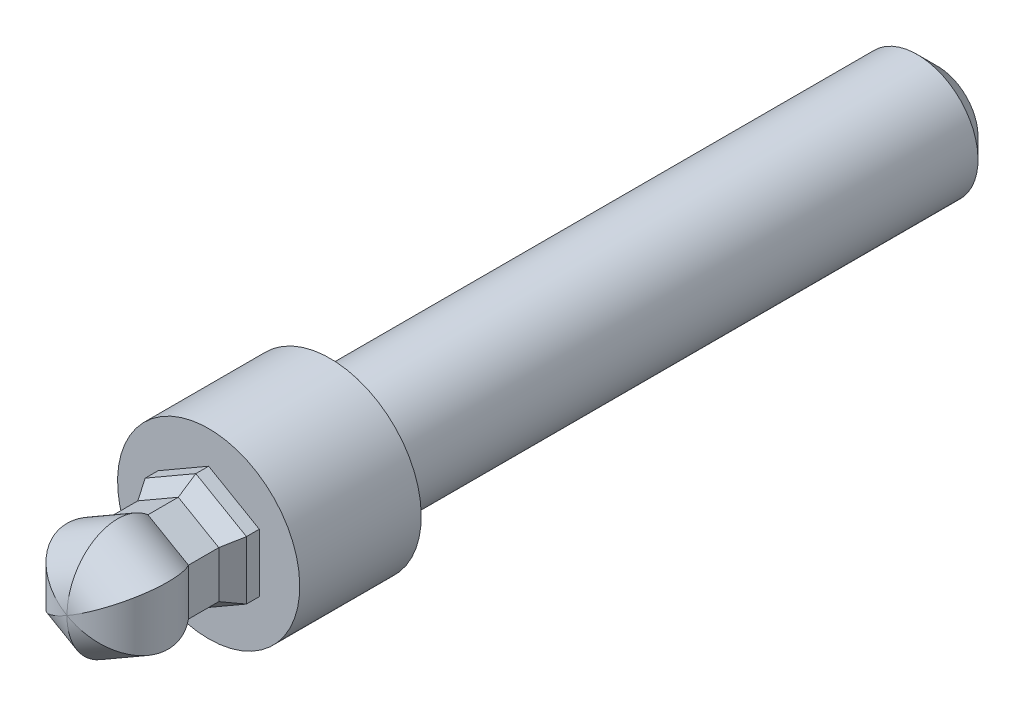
ISO-10303-21;
HEADER;
FILE_DESCRIPTION(('STEP AP214'),'2;1');
FILE_NAME('part.step','',(''),(''),'','','');
FILE_SCHEMA(('AUTOMOTIVE_DESIGN { 1 0 10303 214 1 1 1 1 }'));
ENDSEC;
DATA;
#1=APPLICATION_CONTEXT('core data for automotive mechanical design processes');
#2=APPLICATION_PROTOCOL_DEFINITION('international standard','automotive_design',2000,#1);
#3=PRODUCT_CONTEXT('',#1,'mechanical');
#4=PRODUCT('Part','Part','',(#3));
#5=PRODUCT_RELATED_PRODUCT_CATEGORY('part','',(#4));
#6=PRODUCT_DEFINITION_FORMATION('','',#4);
#7=PRODUCT_DEFINITION_CONTEXT('part definition',#1,'design');
#8=PRODUCT_DEFINITION('design','',#6,#7);
#9=PRODUCT_DEFINITION_SHAPE('','',#8);
#10=(LENGTH_UNIT() NAMED_UNIT(*) SI_UNIT(.MILLI.,.METRE.));
#11=(NAMED_UNIT(*) PLANE_ANGLE_UNIT() SI_UNIT($,.RADIAN.));
#12=(NAMED_UNIT(*) SI_UNIT($,.STERADIAN.) SOLID_ANGLE_UNIT());
#13=UNCERTAINTY_MEASURE_WITH_UNIT(LENGTH_MEASURE(1.E-05),#10,'distance_accuracy_value','');
#14=(GEOMETRIC_REPRESENTATION_CONTEXT(3) GLOBAL_UNCERTAINTY_ASSIGNED_CONTEXT((#13)) GLOBAL_UNIT_ASSIGNED_CONTEXT((#10,
#11,#12)) REPRESENTATION_CONTEXT('',''));
#15=CARTESIAN_POINT('',(0.,0.,0.));
#16=DIRECTION('',(0.,0.,1.));
#17=DIRECTION('',(1.,0.,0.));
#18=AXIS2_PLACEMENT_3D('',#15,#16,#17);
#19=CARTESIAN_POINT('',(0.,0.,-14.));
#20=DIRECTION('',(0.,0.,-1.));
#21=DIRECTION('',(-0.866025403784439,-0.5,0.));
#22=AXIS2_PLACEMENT_3D('',#19,#20,#21);
#23=PLANE('',#22);
#24=CARTESIAN_POINT('',(0.,0.,-14.));
#25=DIRECTION('',(0.,0.,1.));
#26=DIRECTION('',(0.866025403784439,0.5,0.));
#27=AXIS2_PLACEMENT_3D('',#24,#25,#26);
#28=CIRCLE('',#27,9.);
#29=CARTESIAN_POINT('',(7.79422863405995,4.5,-14.));
#30=VERTEX_POINT('',#29);
#31=EDGE_CURVE('E210',#30,#30,#28,.T.);
#32=ORIENTED_EDGE('',*,*,#31,.T.);
#33=EDGE_LOOP('',(#32));
#34=FACE_BOUND('',#33,.T.);
#35=DIRECTION('',(0.866025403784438,-0.5,0.));
#36=VECTOR('',#35,1.);
#37=CARTESIAN_POINT('',(-2.5,-4.33012701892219,-14.));
#38=LINE('',#37,#36);
#39=CARTESIAN_POINT('',(-5.,-2.88675134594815,-14.));
#40=VERTEX_POINT('',#39);
#41=CARTESIAN_POINT('',(0.,-5.77350269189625,-14.));
#42=VERTEX_POINT('',#41);
#43=EDGE_CURVE('E29',#40,#42,#38,.T.);
#44=ORIENTED_EDGE('',*,*,#43,.F.);
#45=DIRECTION('',(0.,-1.,0.));
#46=VECTOR('',#45,1.);
#47=CARTESIAN_POINT('',(-5.,0.,-14.));
#48=LINE('',#47,#46);
#49=CARTESIAN_POINT('',(-5.,2.88675134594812,-14.));
#50=VERTEX_POINT('',#49);
#51=EDGE_CURVE('E223',#50,#40,#48,.T.);
#52=ORIENTED_EDGE('',*,*,#51,.F.);
#53=DIRECTION('',(-0.866025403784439,-0.5,0.));
#54=VECTOR('',#53,1.);
#55=CARTESIAN_POINT('',(-2.5,4.3301270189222,-14.));
#56=LINE('',#55,#54);
#57=CARTESIAN_POINT('',(0.,5.77350269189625,-14.));
#58=VERTEX_POINT('',#57);
#59=EDGE_CURVE('E37',#58,#50,#56,.T.);
#60=ORIENTED_EDGE('',*,*,#59,.F.);
#61=DIRECTION('',(-0.866025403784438,0.5,0.));
#62=VECTOR('',#61,1.);
#63=CARTESIAN_POINT('',(2.5,4.33012701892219,-14.));
#64=LINE('',#63,#62);
#65=CARTESIAN_POINT('',(5.,2.88675134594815,-14.));
#66=VERTEX_POINT('',#65);
#67=EDGE_CURVE('E213',#66,#58,#64,.T.);
#68=ORIENTED_EDGE('',*,*,#67,.F.);
#69=DIRECTION('',(0.,1.,0.));
#70=VECTOR('',#69,1.);
#71=CARTESIAN_POINT('',(5.,0.,-14.));
#72=LINE('',#71,#70);
#73=CARTESIAN_POINT('',(5.,-2.88675134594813,-14.));
#74=VERTEX_POINT('',#73);
#75=EDGE_CURVE('E216',#74,#66,#72,.T.);
#76=ORIENTED_EDGE('',*,*,#75,.F.);
#77=DIRECTION('',(0.866025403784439,0.5,0.));
#78=VECTOR('',#77,1.);
#79=CARTESIAN_POINT('',(2.5,-4.3301270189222,-14.));
#80=LINE('',#79,#78);
#81=EDGE_CURVE('E219',#42,#74,#80,.T.);
#82=ORIENTED_EDGE('',*,*,#81,.F.);
#83=EDGE_LOOP('',(#44,#52,#60,#68,#76,#82));
#84=FACE_BOUND('',#83,.T.);
#85=ADVANCED_FACE('F14',(#34,#84),#23,.F.);
#86=CARTESIAN_POINT('',(0.,0.,-14.));
#87=DIRECTION('',(0.,0.,1.));
#88=DIRECTION('',(0.866025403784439,0.5,0.));
#89=AXIS2_PLACEMENT_3D('',#86,#87,#88);
#90=CYLINDRICAL_SURFACE('',#89,9.);
#91=ORIENTED_EDGE('',*,*,#31,.F.);
#92=EDGE_LOOP('',(#91));
#93=FACE_BOUND('',#92,.T.);
#94=CARTESIAN_POINT('',(0.,0.,-26.));
#95=DIRECTION('',(0.,0.,1.));
#96=DIRECTION('',(0.866025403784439,0.5,0.));
#97=AXIS2_PLACEMENT_3D('',#94,#95,#96);
#98=CIRCLE('',#97,9.);
#99=CARTESIAN_POINT('',(7.79422863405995,4.5,-26.));
#100=VERTEX_POINT('',#99);
#101=EDGE_CURVE('E207',#100,#100,#98,.T.);
#102=ORIENTED_EDGE('',*,*,#101,.T.);
#103=EDGE_LOOP('',(#102));
#104=FACE_BOUND('',#103,.T.);
#105=ADVANCED_FACE('F264',(#93,#104),#90,.T.);
#106=CARTESIAN_POINT('',(4.5,-7.79422863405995,-26.));
#107=DIRECTION('',(0.,0.,1.));
#108=DIRECTION('',(0.866025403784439,0.5,0.));
#109=AXIS2_PLACEMENT_3D('',#106,#107,#108);
#110=PLANE('',#109);
#111=ORIENTED_EDGE('',*,*,#101,.F.);
#112=EDGE_LOOP('',(#111));
#113=FACE_BOUND('',#112,.T.);
#114=CARTESIAN_POINT('',(0.,0.,-26.));
#115=DIRECTION('',(0.,0.,1.));
#116=DIRECTION('',(0.866025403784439,0.5,0.));
#117=AXIS2_PLACEMENT_3D('',#114,#115,#116);
#118=CIRCLE('',#117,6.);
#119=CARTESIAN_POINT('',(5.19615242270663,3.,-26.));
#120=VERTEX_POINT('',#119);
#121=EDGE_CURVE('E204',#120,#120,#118,.T.);
#122=ORIENTED_EDGE('',*,*,#121,.T.);
#123=EDGE_LOOP('',(#122));
#124=FACE_BOUND('',#123,.T.);
#125=ADVANCED_FACE('F261',(#113,#124),#110,.F.);
#126=CARTESIAN_POINT('',(0.,0.,-14.));
#127=DIRECTION('',(0.,0.,1.));
#128=DIRECTION('',(0.866025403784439,0.5,0.));
#129=AXIS2_PLACEMENT_3D('',#126,#127,#128);
#130=CYLINDRICAL_SURFACE('',#129,6.);
#131=CARTESIAN_POINT('',(0.,0.,-84.));
#132=DIRECTION('',(0.,0.,1.));
#133=DIRECTION('',(0.866025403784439,0.5,0.));
#134=AXIS2_PLACEMENT_3D('',#131,#132,#133);
#135=CIRCLE('',#134,6.);
#136=CARTESIAN_POINT('',(5.19615242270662,2.99999999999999,-84.));
#137=VERTEX_POINT('',#136);
#138=EDGE_CURVE('E22',#137,#137,#135,.T.);
#139=ORIENTED_EDGE('',*,*,#138,.T.);
#140=EDGE_LOOP('',(#139));
#141=FACE_BOUND('',#140,.T.);
#142=ORIENTED_EDGE('',*,*,#121,.F.);
#143=EDGE_LOOP('',(#142));
#144=FACE_BOUND('',#143,.T.);
#145=ADVANCED_FACE('F228',(#141,#144),#130,.T.);
#146=CARTESIAN_POINT('',(3.,-5.19615242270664,-86.));
#147=DIRECTION('',(0.,0.,1.));
#148=DIRECTION('',(0.866025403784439,0.5,0.));
#149=AXIS2_PLACEMENT_3D('',#146,#147,#148);
#150=PLANE('',#149);
#151=CARTESIAN_POINT('',(0.,0.,-86.));
#152=DIRECTION('',(0.,0.,1.));
#153=DIRECTION('',(0.866025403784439,0.5,0.));
#154=AXIS2_PLACEMENT_3D('',#151,#152,#153);
#155=CIRCLE('',#154,4.);
#156=CARTESIAN_POINT('',(3.46410161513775,1.99999999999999,-86.));
#157=VERTEX_POINT('',#156);
#158=EDGE_CURVE('E9',#157,#157,#155,.F.);
#159=ORIENTED_EDGE('',*,*,#158,.T.);
#160=EDGE_LOOP('',(#159));
#161=FACE_BOUND('',#160,.T.);
#162=ADVANCED_FACE('F234',(#161),#150,.F.);
#163=CARTESIAN_POINT('',(21.650635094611,12.5,-5.));
#164=DIRECTION('',(-0.866025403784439,-0.5,0.));
#165=DIRECTION('',(0.,0.,1.));
#166=AXIS2_PLACEMENT_3D('',#163,#164,#165);
#167=CYLINDRICAL_SURFACE('',#166,5.);
#168=DIRECTION('',(-0.866025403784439,-0.5,0.));
#169=VECTOR('',#168,1.);
#170=CARTESIAN_POINT('',(19.650635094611,15.9641016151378,-8.));
#171=LINE('',#170,#169);
#172=CARTESIAN_POINT('',(0.,4.618802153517,-8.));
#173=VERTEX_POINT('',#172);
#174=CARTESIAN_POINT('',(-4.,2.30940107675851,-8.));
#175=VERTEX_POINT('',#174);
#176=EDGE_CURVE('E170',#173,#175,#171,.T.);
#177=ORIENTED_EDGE('',*,*,#176,.T.);
#178=CARTESIAN_POINT('',(0.,0.,-5.));
#179=DIRECTION('',(-0.5,-0.866025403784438,0.));
#180=DIRECTION('',(-0.866025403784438,0.5,0.));
#181=AXIS2_PLACEMENT_3D('',#178,#179,#180);
#182=ELLIPSE('',#181,5.77350269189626,5.);
#183=CARTESIAN_POINT('',(0.,0.,0.));
#184=VERTEX_POINT('',#183);
#185=EDGE_CURVE('E191',#175,#184,#182,.F.);
#186=ORIENTED_EDGE('',*,*,#185,.T.);
#187=CARTESIAN_POINT('',(0.,0.,-5.));
#188=DIRECTION('',(-1.,0.,0.));
#189=DIRECTION('',(0.,-1.,0.));
#190=AXIS2_PLACEMENT_3D('',#187,#188,#189);
#191=ELLIPSE('',#190,5.77350269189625,5.);
#192=EDGE_CURVE('E134',#184,#173,#191,.T.);
#193=ORIENTED_EDGE('',*,*,#192,.T.);
#194=EDGE_LOOP('',(#177,#186,#193));
#195=FACE_BOUND('',#194,.T.);
#196=ADVANCED_FACE('F243',(#195),#167,.T.);
#197=DIRECTION('',(-0.866025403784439,-0.5,0.));
#198=VECTOR('',#197,1.);
#199=CARTESIAN_POINT('',(23.650635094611,9.03589838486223,-8.));
#200=LINE('',#199,#198);
#201=CARTESIAN_POINT('',(4.,-2.3094010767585,-8.));
#202=VERTEX_POINT('',#201);
#203=CARTESIAN_POINT('',(0.,-4.618802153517,-8.));
#204=VERTEX_POINT('',#203);
#205=EDGE_CURVE('E169',#202,#204,#200,.T.);
#206=ORIENTED_EDGE('',*,*,#205,.F.);
#207=CARTESIAN_POINT('',(0.,0.,-5.));
#208=DIRECTION('',(-0.5,-0.866025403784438,0.));
#209=DIRECTION('',(-0.866025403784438,0.5,0.));
#210=AXIS2_PLACEMENT_3D('',#207,#208,#209);
#211=ELLIPSE('',#210,5.77350269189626,5.);
#212=EDGE_CURVE('E127',#202,#184,#211,.T.);
#213=ORIENTED_EDGE('',*,*,#212,.T.);
#214=CARTESIAN_POINT('',(0.,0.,-5.));
#215=DIRECTION('',(-1.,0.,0.));
#216=DIRECTION('',(0.,-1.,0.));
#217=AXIS2_PLACEMENT_3D('',#214,#215,#216);
#218=ELLIPSE('',#217,5.77350269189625,5.);
#219=EDGE_CURVE('E173',#184,#204,#218,.F.);
#220=ORIENTED_EDGE('',*,*,#219,.T.);
#221=EDGE_LOOP('',(#206,#213,#220));
#222=FACE_BOUND('',#221,.T.);
#223=ADVANCED_FACE('F247',(#222),#167,.T.);
#224=CARTESIAN_POINT('',(-21.650635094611,12.5,-5.));
#225=DIRECTION('',(0.866025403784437,-0.5,0.));
#226=DIRECTION('',(-0.5,-0.866025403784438,0.));
#227=AXIS2_PLACEMENT_3D('',#224,#225,#226);
#228=CYLINDRICAL_SURFACE('',#227,5.);
#229=CARTESIAN_POINT('',(0.,0.,-5.));
#230=DIRECTION('',(0.5,-0.866025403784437,0.));
#231=DIRECTION('',(-0.866025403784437,-0.5,0.));
#232=AXIS2_PLACEMENT_3D('',#229,#230,#231);
#233=ELLIPSE('',#232,5.77350269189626,5.);
#234=CARTESIAN_POINT('',(-4.,-2.30940107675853,-8.));
#235=VERTEX_POINT('',#234);
#236=EDGE_CURVE('E136',#235,#184,#233,.F.);
#237=ORIENTED_EDGE('',*,*,#236,.F.);
#238=DIRECTION('',(0.866025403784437,-0.5,0.));
#239=VECTOR('',#238,1.);
#240=CARTESIAN_POINT('',(-23.650635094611,9.03589838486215,-8.));
#241=LINE('',#240,#239);
#242=EDGE_CURVE('E539',#235,#204,#241,.T.);
#243=ORIENTED_EDGE('',*,*,#242,.T.);
#244=ORIENTED_EDGE('',*,*,#219,.F.);
#245=EDGE_LOOP('',(#237,#243,#244));
#246=FACE_BOUND('',#245,.T.);
#247=ADVANCED_FACE('F253',(#246),#228,.T.);
#248=CARTESIAN_POINT('',(0.,25.,-5.));
#249=DIRECTION('',(0.,-1.,0.));
#250=DIRECTION('',(-1.,0.,0.));
#251=AXIS2_PLACEMENT_3D('',#248,#249,#250);
#252=CYLINDRICAL_SURFACE('',#251,5.);
#253=DIRECTION('',(0.,-1.,0.));
#254=VECTOR('',#253,1.);
#255=CARTESIAN_POINT('',(-4.00000000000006,25.,-8.));
#256=LINE('',#255,#254);
#257=EDGE_CURVE('E143',#175,#235,#256,.T.);
#258=ORIENTED_EDGE('',*,*,#257,.T.);
#259=ORIENTED_EDGE('',*,*,#236,.T.);
#260=ORIENTED_EDGE('',*,*,#185,.F.);
#261=EDGE_LOOP('',(#258,#259,#260));
#262=FACE_BOUND('',#261,.T.);
#263=ADVANCED_FACE('F317',(#262),#252,.T.);
#264=DIRECTION('',(0.,-1.,0.));
#265=VECTOR('',#264,1.);
#266=CARTESIAN_POINT('',(3.99999999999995,25.,-8.));
#267=LINE('',#266,#265);
#268=CARTESIAN_POINT('',(4.,2.30940107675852,-8.));
#269=VERTEX_POINT('',#268);
#270=EDGE_CURVE('E123',#269,#202,#267,.T.);
#271=ORIENTED_EDGE('',*,*,#270,.F.);
#272=CARTESIAN_POINT('',(0.,0.,-5.));
#273=DIRECTION('',(0.5,-0.866025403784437,0.));
#274=DIRECTION('',(-0.866025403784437,-0.5,0.));
#275=AXIS2_PLACEMENT_3D('',#272,#273,#274);
#276=ELLIPSE('',#275,5.77350269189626,5.);
#277=EDGE_CURVE('E125',#269,#184,#276,.T.);
#278=ORIENTED_EDGE('',*,*,#277,.T.);
#279=ORIENTED_EDGE('',*,*,#212,.F.);
#280=EDGE_LOOP('',(#271,#278,#279));
#281=FACE_BOUND('',#280,.T.);
#282=ADVANCED_FACE('F124',(#281),#252,.T.);
#283=ORIENTED_EDGE('',*,*,#277,.F.);
#284=DIRECTION('',(0.866025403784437,-0.5,0.));
#285=VECTOR('',#284,1.);
#286=CARTESIAN_POINT('',(-19.6506350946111,15.9641016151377,-8.));
#287=LINE('',#286,#285);
#288=EDGE_CURVE('E106',#173,#269,#287,.T.);
#289=ORIENTED_EDGE('',*,*,#288,.F.);
#290=ORIENTED_EDGE('',*,*,#192,.F.);
#291=EDGE_LOOP('',(#283,#289,#290));
#292=FACE_BOUND('',#291,.T.);
#293=ADVANCED_FACE('F133',(#292),#228,.T.);
#294=CARTESIAN_POINT('',(19.650635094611,15.9641016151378,-8.));
#295=DIRECTION('',(0.5,-0.866025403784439,0.));
#296=DIRECTION('',(0.,0.,1.));
#297=AXIS2_PLACEMENT_3D('',#294,#295,#296);
#298=PLANE('',#297);
#299=DIRECTION('',(-0.866025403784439,-0.5,0.));
#300=VECTOR('',#299,1.);
#301=CARTESIAN_POINT('',(19.650635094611,15.9641016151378,-11.));
#302=LINE('',#301,#300);
#303=CARTESIAN_POINT('',(0.,4.618802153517,-11.));
#304=VERTEX_POINT('',#303);
#305=CARTESIAN_POINT('',(-4.,2.3094010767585,-11.));
#306=VERTEX_POINT('',#305);
#307=EDGE_CURVE('E174',#304,#306,#302,.T.);
#308=ORIENTED_EDGE('',*,*,#307,.T.);
#309=DIRECTION('',(0.,0.,1.));
#310=VECTOR('',#309,1.);
#311=CARTESIAN_POINT('',(-4.,2.3094010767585,-8.));
#312=LINE('',#311,#310);
#313=EDGE_CURVE('E154',#306,#175,#312,.T.);
#314=ORIENTED_EDGE('',*,*,#313,.T.);
#315=ORIENTED_EDGE('',*,*,#176,.F.);
#316=DIRECTION('',(0.,0.,-1.));
#317=VECTOR('',#316,1.);
#318=CARTESIAN_POINT('',(0.,4.618802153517,-8.));
#319=LINE('',#318,#317);
#320=EDGE_CURVE('E114',#173,#304,#319,.T.);
#321=ORIENTED_EDGE('',*,*,#320,.T.);
#322=EDGE_LOOP('',(#308,#314,#315,#321));
#323=FACE_BOUND('',#322,.T.);
#324=ADVANCED_FACE('F343',(#323),#298,.F.);
#325=CARTESIAN_POINT('',(23.650635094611,9.03589838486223,-8.));
#326=DIRECTION('',(-0.5,0.866025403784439,0.));
#327=DIRECTION('',(0.,0.,-1.));
#328=AXIS2_PLACEMENT_3D('',#325,#326,#327);
#329=PLANE('',#328);
#330=DIRECTION('',(-0.866025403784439,-0.5,0.));
#331=VECTOR('',#330,1.);
#332=CARTESIAN_POINT('',(23.650635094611,9.03589838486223,-11.));
#333=LINE('',#332,#331);
#334=CARTESIAN_POINT('',(4.,-2.30940107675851,-11.));
#335=VERTEX_POINT('',#334);
#336=CARTESIAN_POINT('',(0.,-4.61880215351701,-11.));
#337=VERTEX_POINT('',#336);
#338=EDGE_CURVE('E183',#335,#337,#333,.T.);
#339=ORIENTED_EDGE('',*,*,#338,.F.);
#340=DIRECTION('',(0.,0.,1.));
#341=VECTOR('',#340,1.);
#342=CARTESIAN_POINT('',(4.,-2.3094010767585,-8.));
#343=LINE('',#342,#341);
#344=EDGE_CURVE('E152',#335,#202,#343,.T.);
#345=ORIENTED_EDGE('',*,*,#344,.T.);
#346=ORIENTED_EDGE('',*,*,#205,.T.);
#347=DIRECTION('',(0.,0.,-1.));
#348=VECTOR('',#347,1.);
#349=CARTESIAN_POINT('',(0.,-4.618802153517,-8.));
#350=LINE('',#349,#348);
#351=EDGE_CURVE('E142',#204,#337,#350,.T.);
#352=ORIENTED_EDGE('',*,*,#351,.T.);
#353=EDGE_LOOP('',(#339,#345,#346,#352));
#354=FACE_BOUND('',#353,.T.);
#355=ADVANCED_FACE('F256',(#354),#329,.F.);
#356=CARTESIAN_POINT('',(-23.650635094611,9.03589838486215,-8.));
#357=DIRECTION('',(0.5,0.866025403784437,0.));
#358=DIRECTION('',(0.866025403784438,-0.5,0.));
#359=AXIS2_PLACEMENT_3D('',#356,#357,#358);
#360=PLANE('',#359);
#361=ORIENTED_EDGE('',*,*,#242,.F.);
#362=DIRECTION('',(0.,0.,1.));
#363=VECTOR('',#362,1.);
#364=CARTESIAN_POINT('',(-4.,-2.30940107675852,-8.));
#365=LINE('',#364,#363);
#366=CARTESIAN_POINT('',(-4.,-2.30940107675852,-11.));
#367=VERTEX_POINT('',#366);
#368=EDGE_CURVE('E137',#367,#235,#365,.T.);
#369=ORIENTED_EDGE('',*,*,#368,.F.);
#370=DIRECTION('',(0.866025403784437,-0.5,0.));
#371=VECTOR('',#370,1.);
#372=CARTESIAN_POINT('',(-23.650635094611,9.03589838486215,-11.));
#373=LINE('',#372,#371);
#374=EDGE_CURVE('E530',#367,#337,#373,.T.);
#375=ORIENTED_EDGE('',*,*,#374,.T.);
#376=ORIENTED_EDGE('',*,*,#351,.F.);
#377=EDGE_LOOP('',(#361,#369,#375,#376));
#378=FACE_BOUND('',#377,.T.);
#379=ADVANCED_FACE('F360',(#378),#360,.F.);
#380=CARTESIAN_POINT('',(-4.00000000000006,25.,-8.));
#381=DIRECTION('',(1.,0.,0.));
#382=DIRECTION('',(0.,-1.,0.));
#383=AXIS2_PLACEMENT_3D('',#380,#381,#382);
#384=PLANE('',#383);
#385=DIRECTION('',(0.,-1.,0.));
#386=VECTOR('',#385,1.);
#387=CARTESIAN_POINT('',(-4.00000000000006,25.,-11.));
#388=LINE('',#387,#386);
#389=EDGE_CURVE('E147',#306,#367,#388,.T.);
#390=ORIENTED_EDGE('',*,*,#389,.T.);
#391=ORIENTED_EDGE('',*,*,#368,.T.);
#392=ORIENTED_EDGE('',*,*,#257,.F.);
#393=ORIENTED_EDGE('',*,*,#313,.F.);
#394=EDGE_LOOP('',(#390,#391,#392,#393));
#395=FACE_BOUND('',#394,.T.);
#396=ADVANCED_FACE('F369',(#395),#384,.F.);
#397=CARTESIAN_POINT('',(3.99999999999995,25.,-8.));
#398=DIRECTION('',(-1.,0.,0.));
#399=DIRECTION('',(0.,1.,0.));
#400=AXIS2_PLACEMENT_3D('',#397,#398,#399);
#401=PLANE('',#400);
#402=DIRECTION('',(0.,-1.,0.));
#403=VECTOR('',#402,1.);
#404=CARTESIAN_POINT('',(3.99999999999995,25.,-11.));
#405=LINE('',#404,#403);
#406=CARTESIAN_POINT('',(4.,2.30940107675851,-11.));
#407=VERTEX_POINT('',#406);
#408=EDGE_CURVE('E130',#407,#335,#405,.T.);
#409=ORIENTED_EDGE('',*,*,#408,.F.);
#410=DIRECTION('',(0.,0.,1.));
#411=VECTOR('',#410,1.);
#412=CARTESIAN_POINT('',(4.,2.30940107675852,-8.));
#413=LINE('',#412,#411);
#414=EDGE_CURVE('E111',#407,#269,#413,.T.);
#415=ORIENTED_EDGE('',*,*,#414,.T.);
#416=ORIENTED_EDGE('',*,*,#270,.T.);
#417=ORIENTED_EDGE('',*,*,#344,.F.);
#418=EDGE_LOOP('',(#409,#415,#416,#417));
#419=FACE_BOUND('',#418,.T.);
#420=ADVANCED_FACE('F139',(#419),#401,.F.);
#421=CARTESIAN_POINT('',(-19.6506350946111,15.9641016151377,-8.));
#422=DIRECTION('',(-0.5,-0.866025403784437,0.));
#423=DIRECTION('',(-0.866025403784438,0.5,0.));
#424=AXIS2_PLACEMENT_3D('',#421,#422,#423);
#425=PLANE('',#424);
#426=ORIENTED_EDGE('',*,*,#288,.T.);
#427=ORIENTED_EDGE('',*,*,#414,.F.);
#428=DIRECTION('',(0.866025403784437,-0.5,0.));
#429=VECTOR('',#428,1.);
#430=CARTESIAN_POINT('',(-19.6506350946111,15.9641016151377,-11.));
#431=LINE('',#430,#429);
#432=EDGE_CURVE('E119',#304,#407,#431,.T.);
#433=ORIENTED_EDGE('',*,*,#432,.F.);
#434=ORIENTED_EDGE('',*,*,#320,.F.);
#435=EDGE_LOOP('',(#426,#427,#433,#434));
#436=FACE_BOUND('',#435,.T.);
#437=ADVANCED_FACE('F108',(#436),#425,.F.);
#438=CARTESIAN_POINT('',(19.650635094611,15.9641016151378,-11.));
#439=DIRECTION('',(0.433012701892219,-0.75,-0.5));
#440=DIRECTION('',(0.25,-0.43301270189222,0.866025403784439));
#441=AXIS2_PLACEMENT_3D('',#438,#439,#440);
#442=PLANE('',#441);
#443=DIRECTION('',(-0.866025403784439,-0.5,0.));
#444=VECTOR('',#443,1.);
#445=CARTESIAN_POINT('',(19.150635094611,16.8301270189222,-12.7320508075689));
#446=LINE('',#445,#444);
#447=CARTESIAN_POINT('',(0.,5.77350269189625,-12.7320508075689));
#448=VERTEX_POINT('',#447);
#449=CARTESIAN_POINT('',(-5.,2.88675134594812,-12.7320508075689));
#450=VERTEX_POINT('',#449);
#451=EDGE_CURVE('E177',#448,#450,#446,.T.);
#452=ORIENTED_EDGE('',*,*,#451,.T.);
#453=DIRECTION('',(0.480384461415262,-0.277350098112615,0.832050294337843));
#454=VECTOR('',#453,1.);
#455=CARTESIAN_POINT('',(-0.361440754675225,0.208677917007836,-4.69783052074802));
#456=LINE('',#455,#454);
#457=EDGE_CURVE('E166',#450,#306,#456,.T.);
#458=ORIENTED_EDGE('',*,*,#457,.T.);
#459=ORIENTED_EDGE('',*,*,#307,.F.);
#460=DIRECTION('',(0.,0.554700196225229,-0.832050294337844));
#461=VECTOR('',#460,1.);
#462=CARTESIAN_POINT('',(0.,8.10966352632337,-16.2362920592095));
#463=LINE('',#462,#461);
#464=EDGE_CURVE('E163',#304,#448,#463,.T.);
#465=ORIENTED_EDGE('',*,*,#464,.T.);
#466=EDGE_LOOP('',(#452,#458,#459,#465));
#467=FACE_BOUND('',#466,.T.);
#468=ADVANCED_FACE('F396',(#467),#442,.F.);
#469=CARTESIAN_POINT('',(23.650635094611,9.03589838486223,-11.));
#470=DIRECTION('',(-0.433012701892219,0.75,-0.5));
#471=DIRECTION('',(0.25,-0.43301270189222,-0.866025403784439));
#472=AXIS2_PLACEMENT_3D('',#469,#470,#471);
#473=PLANE('',#472);
#474=DIRECTION('',(-0.866025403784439,-0.5,0.));
#475=VECTOR('',#474,1.);
#476=CARTESIAN_POINT('',(24.150635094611,8.1698729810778,-12.7320508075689));
#477=LINE('',#476,#475);
#478=CARTESIAN_POINT('',(5.,-2.88675134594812,-12.7320508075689));
#479=VERTEX_POINT('',#478);
#480=CARTESIAN_POINT('',(0.,-5.77350269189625,-12.7320508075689));
#481=VERTEX_POINT('',#480);
#482=EDGE_CURVE('E180',#479,#481,#477,.T.);
#483=ORIENTED_EDGE('',*,*,#482,.F.);
#484=DIRECTION('',(-0.480384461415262,0.277350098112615,0.832050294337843));
#485=VECTOR('',#484,1.);
#486=CARTESIAN_POINT('',(7.02317462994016,-4.0548317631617,-16.2362920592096));
#487=LINE('',#486,#485);
#488=EDGE_CURVE('E160',#479,#335,#487,.T.);
#489=ORIENTED_EDGE('',*,*,#488,.T.);
#490=ORIENTED_EDGE('',*,*,#338,.T.);
#491=DIRECTION('',(0.,-0.554700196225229,-0.832050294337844));
#492=VECTOR('',#491,1.);
#493=CARTESIAN_POINT('',(0.,-0.417355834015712,-4.69783052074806));
#494=LINE('',#493,#492);
#495=EDGE_CURVE('E157',#337,#481,#494,.T.);
#496=ORIENTED_EDGE('',*,*,#495,.T.);
#497=EDGE_LOOP('',(#483,#489,#490,#496));
#498=FACE_BOUND('',#497,.T.);
#499=ADVANCED_FACE('F405',(#498),#473,.F.);
#500=CARTESIAN_POINT('',(-23.650635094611,9.03589838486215,-11.));
#501=DIRECTION('',(0.433012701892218,0.75,-0.5));
#502=DIRECTION('',(-0.480384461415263,-0.277350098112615,-0.832050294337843));
#503=AXIS2_PLACEMENT_3D('',#500,#501,#502);
#504=PLANE('',#503);
#505=ORIENTED_EDGE('',*,*,#374,.F.);
#506=DIRECTION('',(0.480384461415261,0.277350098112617,0.832050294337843));
#507=VECTOR('',#506,1.);
#508=CARTESIAN_POINT('',(-0.361440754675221,-0.208677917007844,-4.69783052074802));
#509=LINE('',#508,#507);
#510=CARTESIAN_POINT('',(-5.,-2.88675134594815,-12.7320508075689));
#511=VERTEX_POINT('',#510);
#512=EDGE_CURVE('E529',#511,#367,#509,.T.);
#513=ORIENTED_EDGE('',*,*,#512,.F.);
#514=DIRECTION('',(0.866025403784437,-0.5,0.));
#515=VECTOR('',#514,1.);
#516=CARTESIAN_POINT('',(-24.1506350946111,8.1698729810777,-12.7320508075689));
#517=LINE('',#516,#515);
#518=EDGE_CURVE('E524',#511,#481,#517,.T.);
#519=ORIENTED_EDGE('',*,*,#518,.T.);
#520=ORIENTED_EDGE('',*,*,#495,.F.);
#521=EDGE_LOOP('',(#505,#513,#519,#520));
#522=FACE_BOUND('',#521,.T.);
#523=ADVANCED_FACE('F415',(#522),#504,.F.);
#524=CARTESIAN_POINT('',(-4.00000000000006,25.,-11.));
#525=DIRECTION('',(0.866025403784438,0.,-0.5));
#526=DIRECTION('',(-0.480384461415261,-0.277350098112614,-0.832050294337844));
#527=AXIS2_PLACEMENT_3D('',#524,#525,#526);
#528=PLANE('',#527);
#529=DIRECTION('',(0.,-1.,0.));
#530=VECTOR('',#529,1.);
#531=CARTESIAN_POINT('',(-5.00000000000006,25.,-12.7320508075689));
#532=LINE('',#531,#530);
#533=EDGE_CURVE('E551',#450,#511,#532,.T.);
#534=ORIENTED_EDGE('',*,*,#533,.T.);
#535=ORIENTED_EDGE('',*,*,#512,.T.);
#536=ORIENTED_EDGE('',*,*,#389,.F.);
#537=ORIENTED_EDGE('',*,*,#457,.F.);
#538=EDGE_LOOP('',(#534,#535,#536,#537));
#539=FACE_BOUND('',#538,.T.);
#540=ADVANCED_FACE('F424',(#539),#528,.F.);
#541=CARTESIAN_POINT('',(3.99999999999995,25.,-11.));
#542=DIRECTION('',(-0.866025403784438,0.,-0.5));
#543=DIRECTION('',(-0.480384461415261,-0.277350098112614,0.832050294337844));
#544=AXIS2_PLACEMENT_3D('',#541,#542,#543);
#545=PLANE('',#544);
#546=DIRECTION('',(0.,-1.,0.));
#547=VECTOR('',#546,1.);
#548=CARTESIAN_POINT('',(5.,25.,-12.7320508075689));
#549=LINE('',#548,#547);
#550=CARTESIAN_POINT('',(5.,2.88675134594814,-12.7320508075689));
#551=VERTEX_POINT('',#550);
#552=EDGE_CURVE('E554',#551,#479,#549,.T.);
#553=ORIENTED_EDGE('',*,*,#552,.F.);
#554=DIRECTION('',(-0.480384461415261,-0.277350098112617,0.832050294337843));
#555=VECTOR('',#554,1.);
#556=CARTESIAN_POINT('',(7.02317462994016,4.05483176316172,-16.2362920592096));
#557=LINE('',#556,#555);
#558=EDGE_CURVE('E558',#551,#407,#557,.T.);
#559=ORIENTED_EDGE('',*,*,#558,.T.);
#560=ORIENTED_EDGE('',*,*,#408,.T.);
#561=ORIENTED_EDGE('',*,*,#488,.F.);
#562=EDGE_LOOP('',(#553,#559,#560,#561));
#563=FACE_BOUND('',#562,.T.);
#564=ADVANCED_FACE('F434',(#563),#545,.F.);
#565=CARTESIAN_POINT('',(-19.6506350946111,15.9641016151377,-11.));
#566=DIRECTION('',(-0.433012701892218,-0.75,-0.5));
#567=DIRECTION('',(-0.480384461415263,-0.277350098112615,0.832050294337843));
#568=AXIS2_PLACEMENT_3D('',#565,#566,#567);
#569=PLANE('',#568);
#570=ORIENTED_EDGE('',*,*,#432,.T.);
#571=ORIENTED_EDGE('',*,*,#558,.F.);
#572=DIRECTION('',(0.866025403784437,-0.5,0.));
#573=VECTOR('',#572,1.);
#574=CARTESIAN_POINT('',(-19.1506350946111,16.8301270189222,-12.7320508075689));
#575=LINE('',#574,#573);
#576=EDGE_CURVE('E531',#448,#551,#575,.T.);
#577=ORIENTED_EDGE('',*,*,#576,.F.);
#578=ORIENTED_EDGE('',*,*,#464,.F.);
#579=EDGE_LOOP('',(#570,#571,#577,#578));
#580=FACE_BOUND('',#579,.T.);
#581=ADVANCED_FACE('F444',(#580),#569,.F.);
#582=CARTESIAN_POINT('',(-19.1506350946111,16.8301270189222,-12.7320508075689));
#583=DIRECTION('',(-0.5,-0.866025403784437,0.));
#584=DIRECTION('',(-0.866025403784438,0.5,0.));
#585=AXIS2_PLACEMENT_3D('',#582,#583,#584);
#586=PLANE('',#585);
#587=DIRECTION('',(0.,0.,1.));
#588=VECTOR('',#587,1.);
#589=CARTESIAN_POINT('',(5.,2.88675134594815,-12.7320508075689));
#590=LINE('',#589,#588);
#591=EDGE_CURVE('E544',#66,#551,#590,.T.);
#592=ORIENTED_EDGE('',*,*,#591,.F.);
#593=ORIENTED_EDGE('',*,*,#67,.T.);
#594=DIRECTION('',(0.,0.,-1.));
#595=VECTOR('',#594,1.);
#596=CARTESIAN_POINT('',(0.,5.77350269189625,-12.7320508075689));
#597=LINE('',#596,#595);
#598=EDGE_CURVE('E200',#448,#58,#597,.T.);
#599=ORIENTED_EDGE('',*,*,#598,.F.);
#600=ORIENTED_EDGE('',*,*,#576,.T.);
#601=EDGE_LOOP('',(#592,#593,#599,#600));
#602=FACE_BOUND('',#601,.T.);
#603=ADVANCED_FACE('F454',(#602),#586,.F.);
#604=CARTESIAN_POINT('',(5.,25.,-12.7320508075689));
#605=DIRECTION('',(-1.,0.,0.));
#606=DIRECTION('',(0.,1.,0.));
#607=AXIS2_PLACEMENT_3D('',#604,#605,#606);
#608=PLANE('',#607);
#609=DIRECTION('',(0.,0.,1.));
#610=VECTOR('',#609,1.);
#611=CARTESIAN_POINT('',(5.,-2.88675134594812,-12.7320508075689));
#612=LINE('',#611,#610);
#613=EDGE_CURVE('E198',#74,#479,#612,.T.);
#614=ORIENTED_EDGE('',*,*,#613,.F.);
#615=ORIENTED_EDGE('',*,*,#75,.T.);
#616=ORIENTED_EDGE('',*,*,#591,.T.);
#617=ORIENTED_EDGE('',*,*,#552,.T.);
#618=EDGE_LOOP('',(#614,#615,#616,#617));
#619=FACE_BOUND('',#618,.T.);
#620=ADVANCED_FACE('F464',(#619),#608,.F.);
#621=CARTESIAN_POINT('',(-5.00000000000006,25.,-12.7320508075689));
#622=DIRECTION('',(1.,0.,0.));
#623=DIRECTION('',(0.,-1.,0.));
#624=AXIS2_PLACEMENT_3D('',#621,#622,#623);
#625=PLANE('',#624);
#626=DIRECTION('',(0.,0.,1.));
#627=VECTOR('',#626,1.);
#628=CARTESIAN_POINT('',(-5.,2.88675134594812,-12.7320508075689));
#629=LINE('',#628,#627);
#630=EDGE_CURVE('E202',#50,#450,#629,.T.);
#631=ORIENTED_EDGE('',*,*,#630,.F.);
#632=ORIENTED_EDGE('',*,*,#51,.T.);
#633=DIRECTION('',(0.,0.,1.));
#634=VECTOR('',#633,1.);
#635=CARTESIAN_POINT('',(-5.,-2.88675134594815,-12.7320508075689));
#636=LINE('',#635,#634);
#637=EDGE_CURVE('E131',#40,#511,#636,.T.);
#638=ORIENTED_EDGE('',*,*,#637,.T.);
#639=ORIENTED_EDGE('',*,*,#533,.F.);
#640=EDGE_LOOP('',(#631,#632,#638,#639));
#641=FACE_BOUND('',#640,.T.);
#642=ADVANCED_FACE('F474',(#641),#625,.F.);
#643=CARTESIAN_POINT('',(-24.1506350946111,8.1698729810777,-12.7320508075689));
#644=DIRECTION('',(0.5,0.866025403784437,0.));
#645=DIRECTION('',(0.866025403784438,-0.5,0.));
#646=AXIS2_PLACEMENT_3D('',#643,#644,#645);
#647=PLANE('',#646);
#648=ORIENTED_EDGE('',*,*,#637,.F.);
#649=ORIENTED_EDGE('',*,*,#43,.T.);
#650=DIRECTION('',(0.,0.,-1.));
#651=VECTOR('',#650,1.);
#652=CARTESIAN_POINT('',(0.,-5.77350269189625,-12.7320508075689));
#653=LINE('',#652,#651);
#654=EDGE_CURVE('E195',#481,#42,#653,.T.);
#655=ORIENTED_EDGE('',*,*,#654,.F.);
#656=ORIENTED_EDGE('',*,*,#518,.F.);
#657=EDGE_LOOP('',(#648,#649,#655,#656));
#658=FACE_BOUND('',#657,.T.);
#659=ADVANCED_FACE('F484',(#658),#647,.F.);
#660=CARTESIAN_POINT('',(24.150635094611,8.1698729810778,-12.7320508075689));
#661=DIRECTION('',(-0.5,0.866025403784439,0.));
#662=DIRECTION('',(0.,0.,-1.));
#663=AXIS2_PLACEMENT_3D('',#660,#661,#662);
#664=PLANE('',#663);
#665=ORIENTED_EDGE('',*,*,#654,.T.);
#666=ORIENTED_EDGE('',*,*,#81,.T.);
#667=ORIENTED_EDGE('',*,*,#613,.T.);
#668=ORIENTED_EDGE('',*,*,#482,.T.);
#669=EDGE_LOOP('',(#665,#666,#667,#668));
#670=FACE_BOUND('',#669,.T.);
#671=ADVANCED_FACE('F239',(#670),#664,.F.);
#672=CARTESIAN_POINT('',(19.150635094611,16.8301270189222,-12.7320508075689));
#673=DIRECTION('',(0.5,-0.866025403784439,0.));
#674=DIRECTION('',(0.,0.,1.));
#675=AXIS2_PLACEMENT_3D('',#672,#673,#674);
#676=PLANE('',#675);
#677=ORIENTED_EDGE('',*,*,#598,.T.);
#678=ORIENTED_EDGE('',*,*,#59,.T.);
#679=ORIENTED_EDGE('',*,*,#630,.T.);
#680=ORIENTED_EDGE('',*,*,#451,.F.);
#681=EDGE_LOOP('',(#677,#678,#679,#680));
#682=FACE_BOUND('',#681,.T.);
#683=ADVANCED_FACE('F232',(#682),#676,.F.);
#684=CARTESIAN_POINT('',(0.,0.,-84.));
#685=DIRECTION('',(0.,0.,1.));
#686=DIRECTION('',(0.866025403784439,0.5,0.));
#687=AXIS2_PLACEMENT_3D('',#684,#685,#686);
#688=CONICAL_SURFACE('',#687,6.,0.785398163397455);
#689=ORIENTED_EDGE('',*,*,#158,.F.);
#690=EDGE_LOOP('',(#689));
#691=FACE_BOUND('',#690,.T.);
#692=ORIENTED_EDGE('',*,*,#138,.F.);
#693=EDGE_LOOP('',(#692));
#694=FACE_BOUND('',#693,.T.);
#695=ADVANCED_FACE('F16',(#691,#694),#688,.T.);
#696=CLOSED_SHELL('',(#85,#105,#125,#145,#162,#196,#223,#247,#263,#282,#293,#324,#355,#379,#396,
#420,#437,#468,#499,#523,#540,#564,#581,#603,#620,#642,#659,#671,#683,#695));
#697=MANIFOLD_SOLID_BREP('B1',#696);
#698=ADVANCED_BREP_SHAPE_REPRESENTATION('',(#18,#697),#14);
#699=SHAPE_DEFINITION_REPRESENTATION(#9,#698);
ENDSEC;
END-ISO-10303-21;
